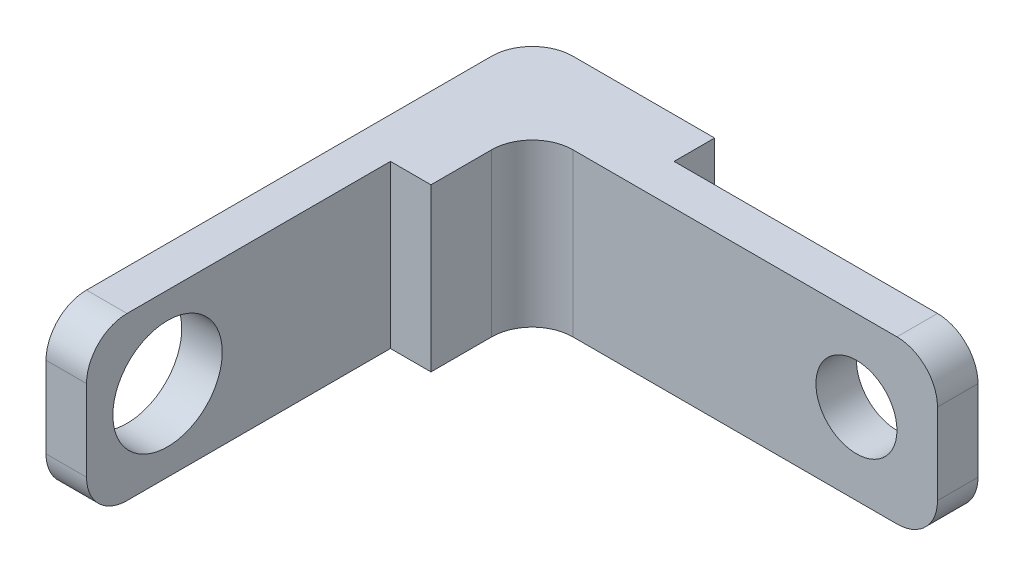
from build123d import *

# Parameters (mm, degrees)
SKETCH2_W           = 120
SKETCH2_H           = 40
BOSS_EXTRUDE1_DEPTH = 20
SKETCH3_W           = 20
SKETCH3_H           = 40
BOSS_EXTRUDE2_DEPTH = 100
SKETCH4_W           = 75
SKETCH4_H           = 40
CUT_EXTRUDE1_DEPTH  = 10
SKETCH5_W           = 75
SKETCH5_H           = 40
CUT_EXTRUDE2_DEPTH  = 10
CUT_EXTRUDE3_REACH  = 166.012
SKETCH6_R           = 13.5
FILLET2_R           = 10
SKETCH7_R           = 10
CUT_EXTRUDE4_DEPTH  = 10
FILLET3_R           = 10


with BuildPart() as part:
    # Sketch2 → Boss-Extrude1 (new body)
    with BuildSketch(Plane.XY):
        Rectangle(SKETCH2_W, SKETCH2_H)
    extrude(amount=BOSS_EXTRUDE1_DEPTH)

    # Sketch3 → Boss-Extrude2 (add)
    with BuildSketch(Plane.XY.offset(20)):
        with Locations((-50, 0)):
            Rectangle(SKETCH3_W, SKETCH3_H)
    extrude(amount=BOSS_EXTRUDE2_DEPTH)

    # Sketch4 → Cut-Extrude1 (cut)
    with BuildSketch(Plane(origin=(0, 0, 0), x_dir=(-1, 0, 0), z_dir=(0, 0, -1))):
        with Locations((-22.5, 0)):
            Rectangle(SKETCH4_W, SKETCH4_H)
    extrude(amount=-CUT_EXTRUDE1_DEPTH, mode=Mode.SUBTRACT)

    # Sketch5 → Cut-Extrude2 (cut)
    with BuildSketch(Plane(origin=(-40, 0, 0), x_dir=(0, 0, -1), z_dir=(1, 0, 0))):
        with Locations((-82.5, 0)):
            Rectangle(SKETCH5_W, SKETCH5_H)
    extrude(amount=-CUT_EXTRUDE2_DEPTH, mode=Mode.SUBTRACT)

    # Sketch6 → Cut-Extrude3 (cut, up to next)
    with BuildSketch(Plane(origin=(-50, 0, 0), x_dir=(0, 0, -1), z_dir=(1, 0, 0)), mode=Mode.PRIVATE) as cut_extrude3_sk1:
        with Locations(Location((-100, 0, 0), (0, 0, 90))):
            Circle(SKETCH6_R)
    cut_extrude3_tool1 = extrude(cut_extrude3_sk1.sketch, amount=-CUT_EXTRUDE3_REACH, mode=Mode.PRIVATE) & part.part
    add(cut_extrude3_tool1.solids().sort_by_distance((-50, 0, 100))[0], mode=Mode.SUBTRACT)

    # Fillet2
    fillet2_edges = [part.edges().sort_by_distance(p)[0] for p in [
        (60, 20, 15),
        (60, -20, 15),
        (-55, -20, 120),
        (-55, 20, 120),
        (-60, 0, 0),
    ]]
    fillet(fillet2_edges, radius=FILLET2_R)

    # Sketch7 → Cut-Extrude4 (cut)
    with BuildSketch(Plane.XY.offset(20)):
        with Locations((40, 0)):
            Circle(SKETCH7_R)
    extrude(amount=-CUT_EXTRUDE4_DEPTH, mode=Mode.SUBTRACT)

    # Fillet3
    fillet3_edges = [part.edges().sort_by_distance(p)[0] for p in [
        (-40, 0, 20),
    ]]
    fillet(fillet3_edges, radius=FILLET3_R)


solid = part.part
